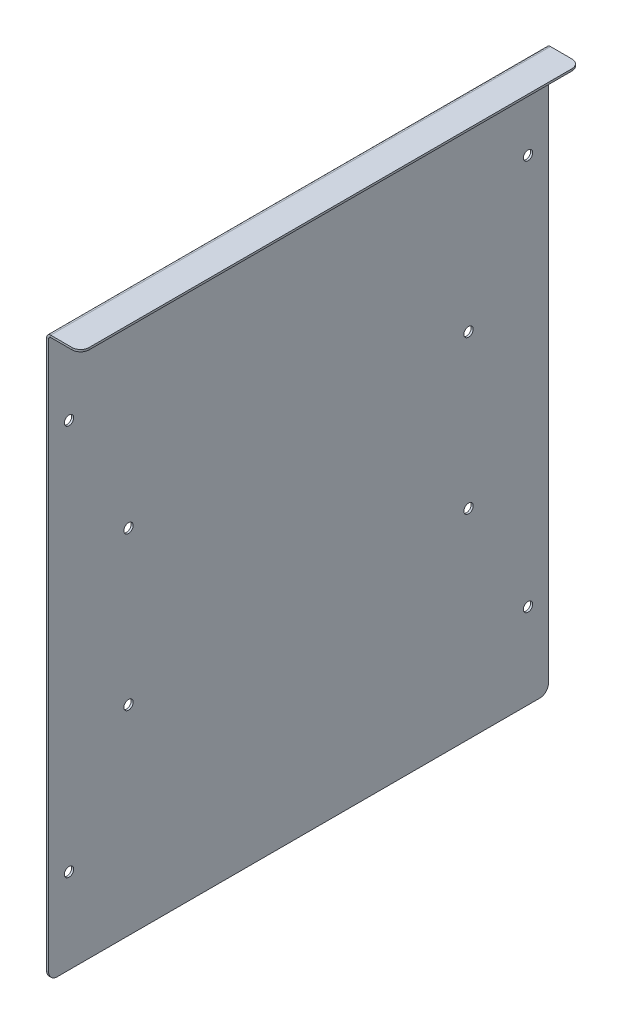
ISO-10303-21;
HEADER;
FILE_DESCRIPTION(('STEP AP214'),'2;1');
FILE_NAME('part.step','',(''),(''),'','','');
FILE_SCHEMA(('AUTOMOTIVE_DESIGN { 1 0 10303 214 1 1 1 1 }'));
ENDSEC;
DATA;
#1=APPLICATION_CONTEXT('core data for automotive mechanical design processes');
#2=APPLICATION_PROTOCOL_DEFINITION('international standard','automotive_design',2000,#1);
#3=PRODUCT_CONTEXT('',#1,'mechanical');
#4=PRODUCT('Part','Part','',(#3));
#5=PRODUCT_RELATED_PRODUCT_CATEGORY('part','',(#4));
#6=PRODUCT_DEFINITION_FORMATION('','',#4);
#7=PRODUCT_DEFINITION_CONTEXT('part definition',#1,'design');
#8=PRODUCT_DEFINITION('design','',#6,#7);
#9=PRODUCT_DEFINITION_SHAPE('','',#8);
#10=(LENGTH_UNIT() NAMED_UNIT(*) SI_UNIT(.MILLI.,.METRE.));
#11=(NAMED_UNIT(*) PLANE_ANGLE_UNIT() SI_UNIT($,.RADIAN.));
#12=(NAMED_UNIT(*) SI_UNIT($,.STERADIAN.) SOLID_ANGLE_UNIT());
#13=UNCERTAINTY_MEASURE_WITH_UNIT(LENGTH_MEASURE(1.E-05),#10,'distance_accuracy_value','');
#14=(GEOMETRIC_REPRESENTATION_CONTEXT(3) GLOBAL_UNCERTAINTY_ASSIGNED_CONTEXT((#13)) GLOBAL_UNIT_ASSIGNED_CONTEXT((#10,
#11,#12)) REPRESENTATION_CONTEXT('',''));
#15=CARTESIAN_POINT('',(0.,0.,0.));
#16=DIRECTION('',(0.,0.,1.));
#17=DIRECTION('',(1.,0.,0.));
#18=AXIS2_PLACEMENT_3D('',#15,#16,#17);
#19=CARTESIAN_POINT('',(2.4,330.,294.));
#20=DIRECTION('',(0.,0.,1.));
#21=DIRECTION('',(1.,0.,0.));
#22=AXIS2_PLACEMENT_3D('',#19,#20,#21);
#23=PLANE('',#22);
#24=DIRECTION('',(0.,-1.,0.));
#25=VECTOR('',#24,1.);
#26=CARTESIAN_POINT('',(2.4,330.,294.));
#27=LINE('',#26,#25);
#28=CARTESIAN_POINT('',(2.4,330.,294.));
#29=VERTEX_POINT('',#28);
#30=CARTESIAN_POINT('',(2.4,328.8,294.));
#31=VERTEX_POINT('',#30);
#32=EDGE_CURVE('E132',#29,#31,#27,.T.);
#33=ORIENTED_EDGE('',*,*,#32,.F.);
#34=CARTESIAN_POINT('',(2.4,327.6,294.));
#35=DIRECTION('',(0.,0.,1.));
#36=DIRECTION('',(1.,0.,0.));
#37=AXIS2_PLACEMENT_3D('',#34,#35,#36);
#38=CIRCLE('',#37,2.4);
#39=CARTESIAN_POINT('',(0.,327.6,294.));
#40=VERTEX_POINT('',#39);
#41=EDGE_CURVE('E136',#40,#29,#38,.F.);
#42=ORIENTED_EDGE('',*,*,#41,.F.);
#43=DIRECTION('',(-1.,0.,0.));
#44=VECTOR('',#43,1.);
#45=CARTESIAN_POINT('',(1.2,327.6,294.));
#46=LINE('',#45,#44);
#47=CARTESIAN_POINT('',(1.2,327.6,294.));
#48=VERTEX_POINT('',#47);
#49=EDGE_CURVE('E141',#48,#40,#46,.T.);
#50=ORIENTED_EDGE('',*,*,#49,.F.);
#51=CARTESIAN_POINT('',(2.4,327.6,294.));
#52=DIRECTION('',(0.,0.,1.));
#53=DIRECTION('',(1.,0.,0.));
#54=AXIS2_PLACEMENT_3D('',#51,#52,#53);
#55=CIRCLE('',#54,1.2);
#56=EDGE_CURVE('E138',#48,#31,#55,.F.);
#57=ORIENTED_EDGE('',*,*,#56,.T.);
#58=EDGE_LOOP('',(#33,#42,#50,#57));
#59=FACE_BOUND('',#58,.T.);
#60=ADVANCED_FACE('F39',(#59),#23,.T.);
#61=CARTESIAN_POINT('',(1.2,327.6,294.));
#62=DIRECTION('',(0.,0.,1.));
#63=DIRECTION('',(1.,0.,0.));
#64=AXIS2_PLACEMENT_3D('',#61,#62,#63);
#65=PLANE('',#64);
#66=DIRECTION('',(1.,0.,0.));
#67=VECTOR('',#66,1.);
#68=CARTESIAN_POINT('',(0.,328.8,294.));
#69=LINE('',#68,#67);
#70=CARTESIAN_POINT('',(15.,328.8,294.));
#71=VERTEX_POINT('',#70);
#72=EDGE_CURVE('E159',#31,#71,#69,.T.);
#73=ORIENTED_EDGE('',*,*,#72,.T.);
#74=DIRECTION('',(0.,-1.,0.));
#75=VECTOR('',#74,1.);
#76=CARTESIAN_POINT('',(15.,327.6,294.));
#77=LINE('',#76,#75);
#78=CARTESIAN_POINT('',(15.,330.,294.));
#79=VERTEX_POINT('',#78);
#80=EDGE_CURVE('E11',#71,#79,#77,.F.);
#81=ORIENTED_EDGE('',*,*,#80,.T.);
#82=DIRECTION('',(1.,0.,0.));
#83=VECTOR('',#82,1.);
#84=CARTESIAN_POINT('',(0.,330.,294.));
#85=LINE('',#84,#83);
#86=EDGE_CURVE('E148',#29,#79,#85,.T.);
#87=ORIENTED_EDGE('',*,*,#86,.F.);
#88=ORIENTED_EDGE('',*,*,#32,.T.);
#89=EDGE_LOOP('',(#73,#81,#87,#88));
#90=FACE_BOUND('',#89,.T.);
#91=ADVANCED_FACE('F158',(#90),#65,.T.);
#92=CARTESIAN_POINT('',(0.,327.6,0.));
#93=DIRECTION('',(0.,0.,-1.));
#94=DIRECTION('',(-1.,0.,0.));
#95=AXIS2_PLACEMENT_3D('',#92,#93,#94);
#96=PLANE('',#95);
#97=DIRECTION('',(1.,0.,0.));
#98=VECTOR('',#97,1.);
#99=CARTESIAN_POINT('',(0.,327.6,0.));
#100=LINE('',#99,#98);
#101=CARTESIAN_POINT('',(0.,327.6,0.));
#102=VERTEX_POINT('',#101);
#103=CARTESIAN_POINT('',(1.2,327.6,0.));
#104=VERTEX_POINT('',#103);
#105=EDGE_CURVE('E204',#102,#104,#100,.T.);
#106=ORIENTED_EDGE('',*,*,#105,.F.);
#107=CARTESIAN_POINT('',(2.4,327.6,0.));
#108=DIRECTION('',(0.,0.,1.));
#109=DIRECTION('',(1.,0.,0.));
#110=AXIS2_PLACEMENT_3D('',#107,#108,#109);
#111=CIRCLE('',#110,2.4);
#112=CARTESIAN_POINT('',(2.4,330.,0.));
#113=VERTEX_POINT('',#112);
#114=EDGE_CURVE('E178',#102,#113,#111,.F.);
#115=ORIENTED_EDGE('',*,*,#114,.T.);
#116=DIRECTION('',(0.,1.,0.));
#117=VECTOR('',#116,1.);
#118=CARTESIAN_POINT('',(2.4,328.8,0.));
#119=LINE('',#118,#117);
#120=CARTESIAN_POINT('',(2.4,328.8,0.));
#121=VERTEX_POINT('',#120);
#122=EDGE_CURVE('E202',#121,#113,#119,.T.);
#123=ORIENTED_EDGE('',*,*,#122,.F.);
#124=CARTESIAN_POINT('',(2.4,327.6,0.));
#125=DIRECTION('',(0.,0.,1.));
#126=DIRECTION('',(1.,0.,0.));
#127=AXIS2_PLACEMENT_3D('',#124,#125,#126);
#128=CIRCLE('',#127,1.2);
#129=EDGE_CURVE('E184',#104,#121,#128,.F.);
#130=ORIENTED_EDGE('',*,*,#129,.F.);
#131=EDGE_LOOP('',(#106,#115,#123,#130));
#132=FACE_BOUND('',#131,.T.);
#133=ADVANCED_FACE('F303',(#132),#96,.T.);
#134=CARTESIAN_POINT('',(2.4,328.8,0.));
#135=DIRECTION('',(0.,0.,-1.));
#136=DIRECTION('',(-1.,0.,0.));
#137=AXIS2_PLACEMENT_3D('',#134,#135,#136);
#138=PLANE('',#137);
#139=DIRECTION('',(0.,1.,0.));
#140=VECTOR('',#139,1.);
#141=CARTESIAN_POINT('',(1.2,0.,0.));
#142=LINE('',#141,#140);
#143=CARTESIAN_POINT('',(1.2,5.,0.));
#144=VERTEX_POINT('',#143);
#145=EDGE_CURVE('E182',#144,#104,#142,.T.);
#146=ORIENTED_EDGE('',*,*,#145,.F.);
#147=DIRECTION('',(-1.,0.,0.));
#148=VECTOR('',#147,1.);
#149=CARTESIAN_POINT('',(2.4,5.,0.));
#150=LINE('',#149,#148);
#151=CARTESIAN_POINT('',(0.,5.,0.));
#152=VERTEX_POINT('',#151);
#153=EDGE_CURVE('E140',#144,#152,#150,.T.);
#154=ORIENTED_EDGE('',*,*,#153,.T.);
#155=DIRECTION('',(0.,1.,0.));
#156=VECTOR('',#155,1.);
#157=CARTESIAN_POINT('',(0.,0.,0.));
#158=LINE('',#157,#156);
#159=EDGE_CURVE('E180',#152,#102,#158,.T.);
#160=ORIENTED_EDGE('',*,*,#159,.T.);
#161=ORIENTED_EDGE('',*,*,#105,.T.);
#162=EDGE_LOOP('',(#146,#154,#160,#161));
#163=FACE_BOUND('',#162,.T.);
#164=ADVANCED_FACE('F315',(#163),#138,.T.);
#165=CARTESIAN_POINT('',(0.,328.8,294.));
#166=DIRECTION('',(0.,1.,0.));
#167=DIRECTION('',(0.,0.,1.));
#168=AXIS2_PLACEMENT_3D('',#165,#166,#167);
#169=PLANE('',#168);
#170=DIRECTION('',(1.,0.,0.));
#171=VECTOR('',#170,1.);
#172=CARTESIAN_POINT('',(0.,328.8,0.));
#173=LINE('',#172,#171);
#174=CARTESIAN_POINT('',(15.,328.8,0.));
#175=VERTEX_POINT('',#174);
#176=EDGE_CURVE('E173',#121,#175,#173,.T.);
#177=ORIENTED_EDGE('',*,*,#176,.T.);
#178=CARTESIAN_POINT('',(15.,328.8,5.));
#179=DIRECTION('',(0.,1.,0.));
#180=DIRECTION('',(0.,0.,1.));
#181=AXIS2_PLACEMENT_3D('',#178,#179,#180);
#182=CIRCLE('',#181,5.);
#183=CARTESIAN_POINT('',(20.,328.8,5.));
#184=VERTEX_POINT('',#183);
#185=EDGE_CURVE('E231',#175,#184,#182,.F.);
#186=ORIENTED_EDGE('',*,*,#185,.T.);
#187=DIRECTION('',(0.,0.,-1.));
#188=VECTOR('',#187,1.);
#189=CARTESIAN_POINT('',(20.,328.8,294.));
#190=LINE('',#189,#188);
#191=CARTESIAN_POINT('',(20.,328.8,289.));
#192=VERTEX_POINT('',#191);
#193=EDGE_CURVE('E200',#192,#184,#190,.T.);
#194=ORIENTED_EDGE('',*,*,#193,.F.);
#195=CARTESIAN_POINT('',(15.,328.8,289.));
#196=DIRECTION('',(0.,1.,0.));
#197=DIRECTION('',(0.,0.,1.));
#198=AXIS2_PLACEMENT_3D('',#195,#196,#197);
#199=CIRCLE('',#198,5.);
#200=EDGE_CURVE('E229',#192,#71,#199,.F.);
#201=ORIENTED_EDGE('',*,*,#200,.T.);
#202=ORIENTED_EDGE('',*,*,#72,.F.);
#203=DIRECTION('',(0.,0.,-1.));
#204=VECTOR('',#203,1.);
#205=CARTESIAN_POINT('',(2.4,328.8,294.));
#206=LINE('',#205,#204);
#207=EDGE_CURVE('E172',#31,#121,#206,.T.);
#208=ORIENTED_EDGE('',*,*,#207,.T.);
#209=EDGE_LOOP('',(#177,#186,#194,#201,#202,#208));
#210=FACE_BOUND('',#209,.T.);
#211=ADVANCED_FACE('F293',(#210),#169,.F.);
#212=CARTESIAN_POINT('',(20.,330.,294.));
#213=DIRECTION('',(1.,0.,0.));
#214=DIRECTION('',(0.,0.,-1.));
#215=AXIS2_PLACEMENT_3D('',#212,#213,#214);
#216=PLANE('',#215);
#217=ORIENTED_EDGE('',*,*,#193,.T.);
#218=DIRECTION('',(0.,-1.,0.));
#219=VECTOR('',#218,1.);
#220=CARTESIAN_POINT('',(20.,330.,5.));
#221=LINE('',#220,#219);
#222=CARTESIAN_POINT('',(20.,330.,5.));
#223=VERTEX_POINT('',#222);
#224=EDGE_CURVE('E62',#184,#223,#221,.F.);
#225=ORIENTED_EDGE('',*,*,#224,.T.);
#226=DIRECTION('',(0.,0.,-1.));
#227=VECTOR('',#226,1.);
#228=CARTESIAN_POINT('',(20.,330.,294.));
#229=LINE('',#228,#227);
#230=CARTESIAN_POINT('',(20.,330.,289.));
#231=VERTEX_POINT('',#230);
#232=EDGE_CURVE('E155',#231,#223,#229,.T.);
#233=ORIENTED_EDGE('',*,*,#232,.F.);
#234=DIRECTION('',(0.,-1.,0.));
#235=VECTOR('',#234,1.);
#236=CARTESIAN_POINT('',(20.,330.,289.));
#237=LINE('',#236,#235);
#238=EDGE_CURVE('E233',#231,#192,#237,.T.);
#239=ORIENTED_EDGE('',*,*,#238,.T.);
#240=EDGE_LOOP('',(#217,#225,#233,#239));
#241=FACE_BOUND('',#240,.T.);
#242=ADVANCED_FACE('F291',(#241),#216,.T.);
#243=CARTESIAN_POINT('',(0.,330.,294.));
#244=DIRECTION('',(0.,1.,0.));
#245=DIRECTION('',(0.,0.,1.));
#246=AXIS2_PLACEMENT_3D('',#243,#244,#245);
#247=PLANE('',#246);
#248=ORIENTED_EDGE('',*,*,#232,.T.);
#249=CARTESIAN_POINT('',(15.,330.,5.));
#250=DIRECTION('',(0.,1.,0.));
#251=DIRECTION('',(0.,0.,1.));
#252=AXIS2_PLACEMENT_3D('',#249,#250,#251);
#253=CIRCLE('',#252,5.);
#254=CARTESIAN_POINT('',(15.,330.,0.));
#255=VERTEX_POINT('',#254);
#256=EDGE_CURVE('E48',#223,#255,#253,.T.);
#257=ORIENTED_EDGE('',*,*,#256,.T.);
#258=DIRECTION('',(1.,0.,0.));
#259=VECTOR('',#258,1.);
#260=CARTESIAN_POINT('',(0.,330.,0.));
#261=LINE('',#260,#259);
#262=EDGE_CURVE('E151',#113,#255,#261,.T.);
#263=ORIENTED_EDGE('',*,*,#262,.F.);
#264=DIRECTION('',(0.,0.,-1.));
#265=VECTOR('',#264,1.);
#266=CARTESIAN_POINT('',(2.4,330.,294.));
#267=LINE('',#266,#265);
#268=EDGE_CURVE('E146',#29,#113,#267,.T.);
#269=ORIENTED_EDGE('',*,*,#268,.F.);
#270=ORIENTED_EDGE('',*,*,#86,.T.);
#271=CARTESIAN_POINT('',(15.,330.,289.));
#272=DIRECTION('',(0.,1.,0.));
#273=DIRECTION('',(0.,0.,1.));
#274=AXIS2_PLACEMENT_3D('',#271,#272,#273);
#275=CIRCLE('',#274,5.);
#276=EDGE_CURVE('E237',#79,#231,#275,.T.);
#277=ORIENTED_EDGE('',*,*,#276,.T.);
#278=EDGE_LOOP('',(#248,#257,#263,#269,#270,#277));
#279=FACE_BOUND('',#278,.T.);
#280=ADVANCED_FACE('F147',(#279),#247,.T.);
#281=CARTESIAN_POINT('',(2.4,327.6,294.));
#282=DIRECTION('',(0.,0.,-1.));
#283=DIRECTION('',(-1.,0.,0.));
#284=AXIS2_PLACEMENT_3D('',#281,#282,#283);
#285=CYLINDRICAL_SURFACE('',#284,2.4);
#286=ORIENTED_EDGE('',*,*,#114,.F.);
#287=DIRECTION('',(0.,0.,-1.));
#288=VECTOR('',#287,1.);
#289=CARTESIAN_POINT('',(0.,327.6,294.));
#290=LINE('',#289,#288);
#291=EDGE_CURVE('E156',#40,#102,#290,.T.);
#292=ORIENTED_EDGE('',*,*,#291,.F.);
#293=ORIENTED_EDGE('',*,*,#41,.T.);
#294=ORIENTED_EDGE('',*,*,#268,.T.);
#295=EDGE_LOOP('',(#286,#292,#293,#294));
#296=FACE_BOUND('',#295,.T.);
#297=ADVANCED_FACE('F162',(#296),#285,.T.);
#298=CARTESIAN_POINT('',(0.,0.,294.));
#299=DIRECTION('',(-1.,0.,0.));
#300=DIRECTION('',(0.,0.,1.));
#301=AXIS2_PLACEMENT_3D('',#298,#299,#300);
#302=PLANE('',#301);
#303=CARTESIAN_POINT('',(0.,280.,12.));
#304=DIRECTION('',(-1.,0.,0.));
#305=DIRECTION('',(0.,0.,1.));
#306=AXIS2_PLACEMENT_3D('',#303,#304,#305);
#307=CIRCLE('',#306,2.74999999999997);
#308=CARTESIAN_POINT('',(0.,280.,14.7499999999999));
#309=VERTEX_POINT('',#308);
#310=EDGE_CURVE('E271',#309,#309,#307,.T.);
#311=ORIENTED_EDGE('',*,*,#310,.F.);
#312=EDGE_LOOP('',(#311));
#313=FACE_BOUND('',#312,.T.);
#314=CARTESIAN_POINT('',(0.,50.,12.));
#315=DIRECTION('',(-1.,0.,0.));
#316=DIRECTION('',(0.,0.,1.));
#317=AXIS2_PLACEMENT_3D('',#314,#315,#316);
#318=CIRCLE('',#317,2.74999999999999);
#319=CARTESIAN_POINT('',(0.,50.,14.7499999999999));
#320=VERTEX_POINT('',#319);
#321=EDGE_CURVE('E261',#320,#320,#318,.T.);
#322=ORIENTED_EDGE('',*,*,#321,.F.);
#323=EDGE_LOOP('',(#322));
#324=FACE_BOUND('',#323,.T.);
#325=CARTESIAN_POINT('',(0.,50.,282.));
#326=DIRECTION('',(-1.,0.,0.));
#327=DIRECTION('',(0.,0.,1.));
#328=AXIS2_PLACEMENT_3D('',#325,#326,#327);
#329=CIRCLE('',#328,2.74999999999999);
#330=CARTESIAN_POINT('',(0.,50.,284.75));
#331=VERTEX_POINT('',#330);
#332=EDGE_CURVE('E258',#331,#331,#329,.T.);
#333=ORIENTED_EDGE('',*,*,#332,.F.);
#334=EDGE_LOOP('',(#333));
#335=FACE_BOUND('',#334,.T.);
#336=CARTESIAN_POINT('',(0.,280.,282.));
#337=DIRECTION('',(-1.,0.,0.));
#338=DIRECTION('',(0.,0.,1.));
#339=AXIS2_PLACEMENT_3D('',#336,#337,#338);
#340=CIRCLE('',#339,2.74999999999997);
#341=CARTESIAN_POINT('',(0.,280.,284.75));
#342=VERTEX_POINT('',#341);
#343=EDGE_CURVE('E257',#342,#342,#340,.T.);
#344=ORIENTED_EDGE('',*,*,#343,.F.);
#345=EDGE_LOOP('',(#344));
#346=FACE_BOUND('',#345,.T.);
#347=CARTESIAN_POINT('',(0.,207.6,47.));
#348=DIRECTION('',(-1.,0.,0.));
#349=DIRECTION('',(0.,0.,1.));
#350=AXIS2_PLACEMENT_3D('',#347,#348,#349);
#351=CIRCLE('',#350,2.74999999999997);
#352=CARTESIAN_POINT('',(0.,207.6,49.75));
#353=VERTEX_POINT('',#352);
#354=EDGE_CURVE('E254',#353,#353,#351,.T.);
#355=ORIENTED_EDGE('',*,*,#354,.F.);
#356=EDGE_LOOP('',(#355));
#357=FACE_BOUND('',#356,.T.);
#358=CARTESIAN_POINT('',(0.,117.6,47.));
#359=DIRECTION('',(-1.,0.,0.));
#360=DIRECTION('',(0.,0.,1.));
#361=AXIS2_PLACEMENT_3D('',#358,#359,#360);
#362=CIRCLE('',#361,2.74999999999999);
#363=CARTESIAN_POINT('',(0.,117.6,49.75));
#364=VERTEX_POINT('',#363);
#365=EDGE_CURVE('E250',#364,#364,#362,.T.);
#366=ORIENTED_EDGE('',*,*,#365,.F.);
#367=EDGE_LOOP('',(#366));
#368=FACE_BOUND('',#367,.T.);
#369=CARTESIAN_POINT('',(0.,117.6,247.));
#370=DIRECTION('',(-1.,0.,0.));
#371=DIRECTION('',(0.,0.,1.));
#372=AXIS2_PLACEMENT_3D('',#369,#370,#371);
#373=CIRCLE('',#372,2.74999999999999);
#374=CARTESIAN_POINT('',(0.,117.6,249.75));
#375=VERTEX_POINT('',#374);
#376=EDGE_CURVE('E246',#375,#375,#373,.T.);
#377=ORIENTED_EDGE('',*,*,#376,.F.);
#378=EDGE_LOOP('',(#377));
#379=FACE_BOUND('',#378,.T.);
#380=CARTESIAN_POINT('',(0.,207.6,247.));
#381=DIRECTION('',(-1.,0.,0.));
#382=DIRECTION('',(0.,0.,1.));
#383=AXIS2_PLACEMENT_3D('',#380,#381,#382);
#384=CIRCLE('',#383,2.74999999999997);
#385=CARTESIAN_POINT('',(0.,207.6,249.75));
#386=VERTEX_POINT('',#385);
#387=EDGE_CURVE('E242',#386,#386,#384,.T.);
#388=ORIENTED_EDGE('',*,*,#387,.F.);
#389=EDGE_LOOP('',(#388));
#390=FACE_BOUND('',#389,.T.);
#391=ORIENTED_EDGE('',*,*,#159,.F.);
#392=CARTESIAN_POINT('',(0.,5.,5.));
#393=DIRECTION('',(-1.,0.,0.));
#394=DIRECTION('',(0.,0.,1.));
#395=AXIS2_PLACEMENT_3D('',#392,#393,#394);
#396=CIRCLE('',#395,5.);
#397=CARTESIAN_POINT('',(0.,0.,5.));
#398=VERTEX_POINT('',#397);
#399=EDGE_CURVE('E213',#152,#398,#396,.T.);
#400=ORIENTED_EDGE('',*,*,#399,.T.);
#401=DIRECTION('',(0.,0.,-1.));
#402=VECTOR('',#401,1.);
#403=CARTESIAN_POINT('',(0.,0.,294.));
#404=LINE('',#403,#402);
#405=CARTESIAN_POINT('',(0.,0.,289.));
#406=VERTEX_POINT('',#405);
#407=EDGE_CURVE('E195',#406,#398,#404,.T.);
#408=ORIENTED_EDGE('',*,*,#407,.F.);
#409=CARTESIAN_POINT('',(0.,5.,289.));
#410=DIRECTION('',(-1.,0.,0.));
#411=DIRECTION('',(0.,0.,1.));
#412=AXIS2_PLACEMENT_3D('',#409,#410,#411);
#413=CIRCLE('',#412,5.);
#414=CARTESIAN_POINT('',(0.,5.,294.));
#415=VERTEX_POINT('',#414);
#416=EDGE_CURVE('E211',#406,#415,#413,.T.);
#417=ORIENTED_EDGE('',*,*,#416,.T.);
#418=DIRECTION('',(0.,1.,0.));
#419=VECTOR('',#418,1.);
#420=CARTESIAN_POINT('',(0.,0.,294.));
#421=LINE('',#420,#419);
#422=EDGE_CURVE('E164',#415,#40,#421,.T.);
#423=ORIENTED_EDGE('',*,*,#422,.T.);
#424=ORIENTED_EDGE('',*,*,#291,.T.);
#425=EDGE_LOOP('',(#391,#400,#408,#417,#423,#424));
#426=FACE_BOUND('',#425,.T.);
#427=ADVANCED_FACE('F318',(#313,#324,#335,#346,#357,#368,#379,#390,#426),#302,.T.);
#428=CARTESIAN_POINT('',(1.2,0.,294.));
#429=DIRECTION('',(0.,-1.,0.));
#430=DIRECTION('',(0.,0.,-1.));
#431=AXIS2_PLACEMENT_3D('',#428,#429,#430);
#432=PLANE('',#431);
#433=ORIENTED_EDGE('',*,*,#407,.T.);
#434=DIRECTION('',(-1.,0.,0.));
#435=VECTOR('',#434,1.);
#436=CARTESIAN_POINT('',(1.2,0.,5.));
#437=LINE('',#436,#435);
#438=CARTESIAN_POINT('',(1.2,0.,5.));
#439=VERTEX_POINT('',#438);
#440=EDGE_CURVE('E218',#398,#439,#437,.F.);
#441=ORIENTED_EDGE('',*,*,#440,.T.);
#442=DIRECTION('',(0.,0.,-1.));
#443=VECTOR('',#442,1.);
#444=CARTESIAN_POINT('',(1.2,0.,294.));
#445=LINE('',#444,#443);
#446=CARTESIAN_POINT('',(1.2,0.,289.));
#447=VERTEX_POINT('',#446);
#448=EDGE_CURVE('E192',#447,#439,#445,.T.);
#449=ORIENTED_EDGE('',*,*,#448,.F.);
#450=DIRECTION('',(-1.,0.,0.));
#451=VECTOR('',#450,1.);
#452=CARTESIAN_POINT('',(1.2,0.,289.));
#453=LINE('',#452,#451);
#454=EDGE_CURVE('E215',#447,#406,#453,.T.);
#455=ORIENTED_EDGE('',*,*,#454,.T.);
#456=EDGE_LOOP('',(#433,#441,#449,#455));
#457=FACE_BOUND('',#456,.T.);
#458=ADVANCED_FACE('F329',(#457),#432,.T.);
#459=CARTESIAN_POINT('',(1.2,0.,294.));
#460=DIRECTION('',(-1.,0.,0.));
#461=DIRECTION('',(0.,0.,1.));
#462=AXIS2_PLACEMENT_3D('',#459,#460,#461);
#463=PLANE('',#462);
#464=CARTESIAN_POINT('',(1.2,280.,12.));
#465=DIRECTION('',(-1.,0.,0.));
#466=DIRECTION('',(0.,0.,1.));
#467=AXIS2_PLACEMENT_3D('',#464,#465,#466);
#468=CIRCLE('',#467,2.74999999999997);
#469=CARTESIAN_POINT('',(1.2,280.,14.7499999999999));
#470=VERTEX_POINT('',#469);
#471=EDGE_CURVE('E43',#470,#470,#468,.T.);
#472=ORIENTED_EDGE('',*,*,#471,.T.);
#473=EDGE_LOOP('',(#472));
#474=FACE_BOUND('',#473,.T.);
#475=CARTESIAN_POINT('',(1.2,50.,12.));
#476=DIRECTION('',(-1.,0.,0.));
#477=DIRECTION('',(0.,0.,1.));
#478=AXIS2_PLACEMENT_3D('',#475,#476,#477);
#479=CIRCLE('',#478,2.74999999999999);
#480=CARTESIAN_POINT('',(1.2,50.,14.7499999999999));
#481=VERTEX_POINT('',#480);
#482=EDGE_CURVE('E259',#481,#481,#479,.T.);
#483=ORIENTED_EDGE('',*,*,#482,.T.);
#484=EDGE_LOOP('',(#483));
#485=FACE_BOUND('',#484,.T.);
#486=CARTESIAN_POINT('',(1.2,50.,282.));
#487=DIRECTION('',(-1.,0.,0.));
#488=DIRECTION('',(0.,0.,1.));
#489=AXIS2_PLACEMENT_3D('',#486,#487,#488);
#490=CIRCLE('',#489,2.74999999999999);
#491=CARTESIAN_POINT('',(1.2,50.,284.75));
#492=VERTEX_POINT('',#491);
#493=EDGE_CURVE('E255',#492,#492,#490,.T.);
#494=ORIENTED_EDGE('',*,*,#493,.T.);
#495=EDGE_LOOP('',(#494));
#496=FACE_BOUND('',#495,.T.);
#497=CARTESIAN_POINT('',(1.2,280.,282.));
#498=DIRECTION('',(-1.,0.,0.));
#499=DIRECTION('',(0.,0.,1.));
#500=AXIS2_PLACEMENT_3D('',#497,#498,#499);
#501=CIRCLE('',#500,2.74999999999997);
#502=CARTESIAN_POINT('',(1.2,280.,284.75));
#503=VERTEX_POINT('',#502);
#504=EDGE_CURVE('E276',#503,#503,#501,.T.);
#505=ORIENTED_EDGE('',*,*,#504,.T.);
#506=EDGE_LOOP('',(#505));
#507=FACE_BOUND('',#506,.T.);
#508=CARTESIAN_POINT('',(1.2,207.6,47.));
#509=DIRECTION('',(-1.,0.,0.));
#510=DIRECTION('',(0.,0.,1.));
#511=AXIS2_PLACEMENT_3D('',#508,#509,#510);
#512=CIRCLE('',#511,2.74999999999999);
#513=CARTESIAN_POINT('',(1.2,207.6,49.75));
#514=VERTEX_POINT('',#513);
#515=EDGE_CURVE('E251',#514,#514,#512,.T.);
#516=ORIENTED_EDGE('',*,*,#515,.T.);
#517=EDGE_LOOP('',(#516));
#518=FACE_BOUND('',#517,.T.);
#519=CARTESIAN_POINT('',(1.2,117.6,47.));
#520=DIRECTION('',(-1.,0.,0.));
#521=DIRECTION('',(0.,0.,1.));
#522=AXIS2_PLACEMENT_3D('',#519,#520,#521);
#523=CIRCLE('',#522,2.75);
#524=CARTESIAN_POINT('',(1.2,117.6,49.75));
#525=VERTEX_POINT('',#524);
#526=EDGE_CURVE('E247',#525,#525,#523,.T.);
#527=ORIENTED_EDGE('',*,*,#526,.T.);
#528=EDGE_LOOP('',(#527));
#529=FACE_BOUND('',#528,.T.);
#530=CARTESIAN_POINT('',(1.2,117.6,247.));
#531=DIRECTION('',(-1.,0.,0.));
#532=DIRECTION('',(0.,0.,1.));
#533=AXIS2_PLACEMENT_3D('',#530,#531,#532);
#534=CIRCLE('',#533,2.75);
#535=CARTESIAN_POINT('',(1.2,117.6,249.75));
#536=VERTEX_POINT('',#535);
#537=EDGE_CURVE('E243',#536,#536,#534,.T.);
#538=ORIENTED_EDGE('',*,*,#537,.T.);
#539=EDGE_LOOP('',(#538));
#540=FACE_BOUND('',#539,.T.);
#541=CARTESIAN_POINT('',(1.2,207.6,247.));
#542=DIRECTION('',(-1.,0.,0.));
#543=DIRECTION('',(0.,0.,1.));
#544=AXIS2_PLACEMENT_3D('',#541,#542,#543);
#545=CIRCLE('',#544,2.74999999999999);
#546=CARTESIAN_POINT('',(1.2,207.6,249.75));
#547=VERTEX_POINT('',#546);
#548=EDGE_CURVE('E176',#547,#547,#545,.T.);
#549=ORIENTED_EDGE('',*,*,#548,.T.);
#550=EDGE_LOOP('',(#549));
#551=FACE_BOUND('',#550,.T.);
#552=ORIENTED_EDGE('',*,*,#448,.T.);
#553=CARTESIAN_POINT('',(1.2,5.,5.));
#554=DIRECTION('',(-1.,0.,0.));
#555=DIRECTION('',(0.,0.,1.));
#556=AXIS2_PLACEMENT_3D('',#553,#554,#555);
#557=CIRCLE('',#556,5.);
#558=EDGE_CURVE('E222',#439,#144,#557,.F.);
#559=ORIENTED_EDGE('',*,*,#558,.T.);
#560=ORIENTED_EDGE('',*,*,#145,.T.);
#561=DIRECTION('',(0.,0.,-1.));
#562=VECTOR('',#561,1.);
#563=CARTESIAN_POINT('',(1.2,327.6,294.));
#564=LINE('',#563,#562);
#565=EDGE_CURVE('E189',#48,#104,#564,.T.);
#566=ORIENTED_EDGE('',*,*,#565,.F.);
#567=DIRECTION('',(0.,1.,0.));
#568=VECTOR('',#567,1.);
#569=CARTESIAN_POINT('',(1.2,0.,294.));
#570=LINE('',#569,#568);
#571=CARTESIAN_POINT('',(1.2,5.,294.));
#572=VERTEX_POINT('',#571);
#573=EDGE_CURVE('E166',#572,#48,#570,.T.);
#574=ORIENTED_EDGE('',*,*,#573,.F.);
#575=CARTESIAN_POINT('',(1.2,5.,289.));
#576=DIRECTION('',(-1.,0.,0.));
#577=DIRECTION('',(0.,0.,1.));
#578=AXIS2_PLACEMENT_3D('',#575,#576,#577);
#579=CIRCLE('',#578,5.);
#580=EDGE_CURVE('E220',#572,#447,#579,.F.);
#581=ORIENTED_EDGE('',*,*,#580,.T.);
#582=EDGE_LOOP('',(#552,#559,#560,#566,#574,#581));
#583=FACE_BOUND('',#582,.T.);
#584=ADVANCED_FACE('F309',(#474,#485,#496,#507,#518,#529,#540,#551,#583),#463,.F.);
#585=CARTESIAN_POINT('',(2.4,327.6,294.));
#586=DIRECTION('',(0.,0.,-1.));
#587=DIRECTION('',(-1.,0.,0.));
#588=AXIS2_PLACEMENT_3D('',#585,#586,#587);
#589=CYLINDRICAL_SURFACE('',#588,1.2);
#590=ORIENTED_EDGE('',*,*,#129,.T.);
#591=ORIENTED_EDGE('',*,*,#207,.F.);
#592=ORIENTED_EDGE('',*,*,#56,.F.);
#593=ORIENTED_EDGE('',*,*,#565,.T.);
#594=EDGE_LOOP('',(#590,#591,#592,#593));
#595=FACE_BOUND('',#594,.T.);
#596=ADVANCED_FACE('F305',(#595),#589,.F.);
#597=CARTESIAN_POINT('',(2.4,327.6,294.));
#598=DIRECTION('',(0.,0.,1.));
#599=DIRECTION('',(1.,0.,0.));
#600=AXIS2_PLACEMENT_3D('',#597,#598,#599);
#601=PLANE('',#600);
#602=ORIENTED_EDGE('',*,*,#422,.F.);
#603=DIRECTION('',(-1.,0.,0.));
#604=VECTOR('',#603,1.);
#605=CARTESIAN_POINT('',(2.4,5.,294.));
#606=LINE('',#605,#604);
#607=EDGE_CURVE('E224',#415,#572,#606,.F.);
#608=ORIENTED_EDGE('',*,*,#607,.T.);
#609=ORIENTED_EDGE('',*,*,#573,.T.);
#610=ORIENTED_EDGE('',*,*,#49,.T.);
#611=EDGE_LOOP('',(#602,#608,#609,#610));
#612=FACE_BOUND('',#611,.T.);
#613=ADVANCED_FACE('F323',(#612),#601,.T.);
#614=CARTESIAN_POINT('',(2.4,327.6,0.));
#615=DIRECTION('',(0.,0.,1.));
#616=DIRECTION('',(1.,0.,0.));
#617=AXIS2_PLACEMENT_3D('',#614,#615,#616);
#618=PLANE('',#617);
#619=ORIENTED_EDGE('',*,*,#262,.T.);
#620=DIRECTION('',(0.,-1.,0.));
#621=VECTOR('',#620,1.);
#622=CARTESIAN_POINT('',(15.,328.8,0.));
#623=LINE('',#622,#621);
#624=EDGE_CURVE('E226',#255,#175,#623,.T.);
#625=ORIENTED_EDGE('',*,*,#624,.T.);
#626=ORIENTED_EDGE('',*,*,#176,.F.);
#627=ORIENTED_EDGE('',*,*,#122,.T.);
#628=EDGE_LOOP('',(#619,#625,#626,#627));
#629=FACE_BOUND('',#628,.T.);
#630=ADVANCED_FACE('F299',(#629),#618,.F.);
#631=CARTESIAN_POINT('',(2.4,5.,5.));
#632=DIRECTION('',(-1.,0.,0.));
#633=DIRECTION('',(0.,0.,1.));
#634=AXIS2_PLACEMENT_3D('',#631,#632,#633);
#635=CYLINDRICAL_SURFACE('',#634,5.);
#636=ORIENTED_EDGE('',*,*,#558,.F.);
#637=ORIENTED_EDGE('',*,*,#440,.F.);
#638=ORIENTED_EDGE('',*,*,#399,.F.);
#639=ORIENTED_EDGE('',*,*,#153,.F.);
#640=EDGE_LOOP('',(#636,#637,#638,#639));
#641=FACE_BOUND('',#640,.T.);
#642=ADVANCED_FACE('F332',(#641),#635,.T.);
#643=CARTESIAN_POINT('',(1.2,5.,289.));
#644=DIRECTION('',(-1.,0.,0.));
#645=DIRECTION('',(0.,0.,1.));
#646=AXIS2_PLACEMENT_3D('',#643,#644,#645);
#647=CYLINDRICAL_SURFACE('',#646,5.);
#648=ORIENTED_EDGE('',*,*,#580,.F.);
#649=ORIENTED_EDGE('',*,*,#607,.F.);
#650=ORIENTED_EDGE('',*,*,#416,.F.);
#651=ORIENTED_EDGE('',*,*,#454,.F.);
#652=EDGE_LOOP('',(#648,#649,#650,#651));
#653=FACE_BOUND('',#652,.T.);
#654=ADVANCED_FACE('F325',(#653),#647,.T.);
#655=CARTESIAN_POINT('',(15.,327.6,5.));
#656=DIRECTION('',(0.,1.,0.));
#657=DIRECTION('',(0.,0.,1.));
#658=AXIS2_PLACEMENT_3D('',#655,#656,#657);
#659=CYLINDRICAL_SURFACE('',#658,5.);
#660=ORIENTED_EDGE('',*,*,#256,.F.);
#661=ORIENTED_EDGE('',*,*,#224,.F.);
#662=ORIENTED_EDGE('',*,*,#185,.F.);
#663=ORIENTED_EDGE('',*,*,#624,.F.);
#664=EDGE_LOOP('',(#660,#661,#662,#663));
#665=FACE_BOUND('',#664,.T.);
#666=ADVANCED_FACE('F297',(#665),#659,.T.);
#667=CARTESIAN_POINT('',(15.,330.,289.));
#668=DIRECTION('',(0.,-1.,0.));
#669=DIRECTION('',(0.,0.,-1.));
#670=AXIS2_PLACEMENT_3D('',#667,#668,#669);
#671=CYLINDRICAL_SURFACE('',#670,5.);
#672=ORIENTED_EDGE('',*,*,#276,.F.);
#673=ORIENTED_EDGE('',*,*,#80,.F.);
#674=ORIENTED_EDGE('',*,*,#200,.F.);
#675=ORIENTED_EDGE('',*,*,#238,.F.);
#676=EDGE_LOOP('',(#672,#673,#674,#675));
#677=FACE_BOUND('',#676,.T.);
#678=ADVANCED_FACE('F41',(#677),#671,.T.);
#679=CARTESIAN_POINT('',(0.,207.6,247.));
#680=DIRECTION('',(-1.,0.,0.));
#681=DIRECTION('',(0.,0.,1.));
#682=AXIS2_PLACEMENT_3D('',#679,#680,#681);
#683=CYLINDRICAL_SURFACE('',#682,2.74999999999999);
#684=ORIENTED_EDGE('',*,*,#387,.T.);
#685=EDGE_LOOP('',(#684));
#686=FACE_BOUND('',#685,.T.);
#687=ORIENTED_EDGE('',*,*,#548,.F.);
#688=EDGE_LOOP('',(#687));
#689=FACE_BOUND('',#688,.T.);
#690=ADVANCED_FACE('F372',(#686,#689),#683,.F.);
#691=CARTESIAN_POINT('',(0.,117.6,247.));
#692=DIRECTION('',(-1.,0.,0.));
#693=DIRECTION('',(0.,0.,1.));
#694=AXIS2_PLACEMENT_3D('',#691,#692,#693);
#695=CYLINDRICAL_SURFACE('',#694,2.75);
#696=ORIENTED_EDGE('',*,*,#376,.T.);
#697=EDGE_LOOP('',(#696));
#698=FACE_BOUND('',#697,.T.);
#699=ORIENTED_EDGE('',*,*,#537,.F.);
#700=EDGE_LOOP('',(#699));
#701=FACE_BOUND('',#700,.T.);
#702=ADVANCED_FACE('F375',(#698,#701),#695,.F.);
#703=CARTESIAN_POINT('',(0.,117.6,47.));
#704=DIRECTION('',(-1.,0.,0.));
#705=DIRECTION('',(0.,0.,1.));
#706=AXIS2_PLACEMENT_3D('',#703,#704,#705);
#707=CYLINDRICAL_SURFACE('',#706,2.75);
#708=ORIENTED_EDGE('',*,*,#365,.T.);
#709=EDGE_LOOP('',(#708));
#710=FACE_BOUND('',#709,.T.);
#711=ORIENTED_EDGE('',*,*,#526,.F.);
#712=EDGE_LOOP('',(#711));
#713=FACE_BOUND('',#712,.T.);
#714=ADVANCED_FACE('F379',(#710,#713),#707,.F.);
#715=CARTESIAN_POINT('',(0.,207.6,47.));
#716=DIRECTION('',(-1.,0.,0.));
#717=DIRECTION('',(0.,0.,1.));
#718=AXIS2_PLACEMENT_3D('',#715,#716,#717);
#719=CYLINDRICAL_SURFACE('',#718,2.74999999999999);
#720=ORIENTED_EDGE('',*,*,#354,.T.);
#721=EDGE_LOOP('',(#720));
#722=FACE_BOUND('',#721,.T.);
#723=ORIENTED_EDGE('',*,*,#515,.F.);
#724=EDGE_LOOP('',(#723));
#725=FACE_BOUND('',#724,.T.);
#726=ADVANCED_FACE('F383',(#722,#725),#719,.F.);
#727=CARTESIAN_POINT('',(0.,280.,282.));
#728=DIRECTION('',(-1.,0.,0.));
#729=DIRECTION('',(0.,0.,1.));
#730=AXIS2_PLACEMENT_3D('',#727,#728,#729);
#731=CYLINDRICAL_SURFACE('',#730,2.74999999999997);
#732=ORIENTED_EDGE('',*,*,#343,.T.);
#733=EDGE_LOOP('',(#732));
#734=FACE_BOUND('',#733,.T.);
#735=ORIENTED_EDGE('',*,*,#504,.F.);
#736=EDGE_LOOP('',(#735));
#737=FACE_BOUND('',#736,.T.);
#738=ADVANCED_FACE('F387',(#734,#737),#731,.F.);
#739=CARTESIAN_POINT('',(0.,50.,282.));
#740=DIRECTION('',(-1.,0.,0.));
#741=DIRECTION('',(0.,0.,1.));
#742=AXIS2_PLACEMENT_3D('',#739,#740,#741);
#743=CYLINDRICAL_SURFACE('',#742,2.74999999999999);
#744=ORIENTED_EDGE('',*,*,#332,.T.);
#745=EDGE_LOOP('',(#744));
#746=FACE_BOUND('',#745,.T.);
#747=ORIENTED_EDGE('',*,*,#493,.F.);
#748=EDGE_LOOP('',(#747));
#749=FACE_BOUND('',#748,.T.);
#750=ADVANCED_FACE('F391',(#746,#749),#743,.F.);
#751=CARTESIAN_POINT('',(0.,50.,12.));
#752=DIRECTION('',(-1.,0.,0.));
#753=DIRECTION('',(0.,0.,1.));
#754=AXIS2_PLACEMENT_3D('',#751,#752,#753);
#755=CYLINDRICAL_SURFACE('',#754,2.74999999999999);
#756=ORIENTED_EDGE('',*,*,#321,.T.);
#757=EDGE_LOOP('',(#756));
#758=FACE_BOUND('',#757,.T.);
#759=ORIENTED_EDGE('',*,*,#482,.F.);
#760=EDGE_LOOP('',(#759));
#761=FACE_BOUND('',#760,.T.);
#762=ADVANCED_FACE('F395',(#758,#761),#755,.F.);
#763=CARTESIAN_POINT('',(0.,280.,12.));
#764=DIRECTION('',(-1.,0.,0.));
#765=DIRECTION('',(0.,0.,1.));
#766=AXIS2_PLACEMENT_3D('',#763,#764,#765);
#767=CYLINDRICAL_SURFACE('',#766,2.74999999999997);
#768=ORIENTED_EDGE('',*,*,#310,.T.);
#769=EDGE_LOOP('',(#768));
#770=FACE_BOUND('',#769,.T.);
#771=ORIENTED_EDGE('',*,*,#471,.F.);
#772=EDGE_LOOP('',(#771));
#773=FACE_BOUND('',#772,.T.);
#774=ADVANCED_FACE('F399',(#770,#773),#767,.F.);
#775=CLOSED_SHELL('',(#60,#91,#133,#164,#211,#242,#280,#297,#427,#458,#584,#596,#613,#630,#642,
#654,#666,#678,#690,#702,#714,#726,#738,#750,#762,#774));
#776=MANIFOLD_SOLID_BREP('B2',#775);
#777=ADVANCED_BREP_SHAPE_REPRESENTATION('',(#18,#776),#14);
#778=SHAPE_DEFINITION_REPRESENTATION(#9,#777);
ENDSEC;
END-ISO-10303-21;
